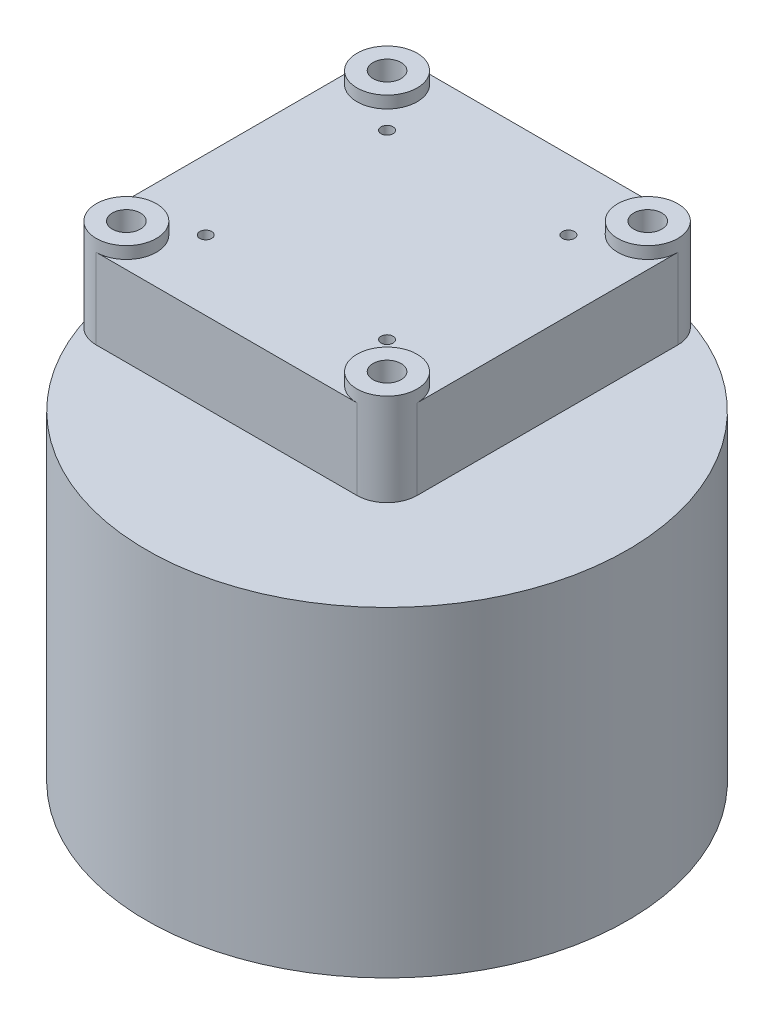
from build123d import *

# Parameters (mm, degrees)
SKETCH1_R           = 3.5
SKETCH1_R_2         = 1.5
BOSS_EXTRUDE1_DEPTH = 20
SKETCH2_R           = 17.5
BOSS_EXTRUDE2_DEPTH = 18
SKETCH3_R           = 60
BOSS_EXTRUDE3_DEPTH = 80
SKETCH4_R           = 7.5
SKETCH4_R_2         = 3.5
BOSS_EXTRUDE5_DEPTH = 3


with BuildPart() as part:
    # Sketch1 → Boss-Extrude1 (new body)
    with BuildSketch(Plane(origin=(0, 0, 0), x_dir=(1, 0, 0), z_dir=(0, 1, 0))):
        with BuildLine():
            Line((-32.5, -40), (32.5, -40))
            ThreePointArc((32.5, -40), (37.803300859, -37.803300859), (40, -32.5))
            Line((40, -32.5), (40, 32.5))
            ThreePointArc((40, 32.5), (37.803300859, 37.803300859), (32.5, 40))
            Line((32.5, 40), (-32.5, 40))
            ThreePointArc((-32.5, 40), (-37.803300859, 37.803300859), (-40, 32.5))
            Line((-40, 32.5), (-40, -32.5))
            ThreePointArc((-40, -32.5), (-37.803300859, -37.803300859), (-32.5, -40))
        make_face()
        with Locations(Location((32.5, 32.5, 0), (0, 0, 270))):
            Circle(SKETCH1_R, mode=Mode.SUBTRACT)
        with Locations(Location((-32.5, -32.5, 0), (0, 0, 90))):
            Circle(SKETCH1_R, mode=Mode.SUBTRACT)
        with Locations(Location((-32.5, 32.5, 0), (0, 0, 90))):
            Circle(SKETCH1_R, mode=Mode.SUBTRACT)
        with Locations(Location((32.5, -32.5, 0), (0, 0, 270))):
            Circle(SKETCH1_R, mode=Mode.SUBTRACT)
        with Locations(Location((22.600505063, -22.600505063, 0), (0, 0, 270))):
            Circle(SKETCH1_R_2, mode=Mode.SUBTRACT)
        with Locations(Location((-22.600505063, -22.600505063, 0), (0, 0, 90))):
            Circle(SKETCH1_R_2, mode=Mode.SUBTRACT)
        with Locations(Location((-22.600505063, 22.600505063, 0), (0, 0, 270))):
            Circle(SKETCH1_R_2, mode=Mode.SUBTRACT)
        with Locations(Location((22.600505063, 22.600505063, 0), (0, 0, 90))):
            Circle(SKETCH1_R_2, mode=Mode.SUBTRACT)
    extrude(amount=BOSS_EXTRUDE1_DEPTH)

    # Sketch2 → Boss-Extrude2 (add)
    with BuildSketch(Plane.XZ):
        with Locations(Location((0, 0, 0), (0, 0, 270))):
            Circle(SKETCH2_R)
    extrude(amount=BOSS_EXTRUDE2_DEPTH)

    # Sketch3 → Boss-Extrude3 (add)
    with BuildSketch(Plane.XZ.offset(18)):
        with Locations(Location((0, 0, 0), (0, 0, 270))):
            Circle(SKETCH3_R)
    extrude(amount=BOSS_EXTRUDE3_DEPTH)

    # Sketch4 → Boss-Extrude5 (add)
    # profile 1 of 4: a face of its own
    with BuildSketch(Plane(origin=(0, 20, 0), x_dir=(1, 0, 0), z_dir=(0, 1, 0))):
        with Locations(Location((32.5, 32.5, 0), (0, 0, 90))):
            Circle(SKETCH4_R)
        with Locations(Location((32.5, 32.5, 0), (0, 0, 270))):
            Circle(SKETCH4_R_2, mode=Mode.SUBTRACT)
    # profile 2 of 4: a face of its own
    with BuildSketch(Plane(origin=(0, 20, 0), x_dir=(1, 0, 0), z_dir=(0, 1, 0))):
        with Locations(Location((32.5, -32.5, 0), (0, 0, 90))):
            Circle(SKETCH4_R)
        with Locations(Location((32.5, -32.5, 0), (0, 0, 90))):
            Circle(SKETCH4_R_2, mode=Mode.SUBTRACT)
    # profile 3 of 4: a face of its own
    with BuildSketch(Plane(origin=(0, 20, 0), x_dir=(1, 0, 0), z_dir=(0, 1, 0))):
        with Locations(Location((-32.5, -32.5, 0), (0, 0, 270))):
            Circle(SKETCH4_R)
        with Locations(Location((-32.5, -32.5, 0), (0, 0, 90))):
            Circle(SKETCH4_R_2, mode=Mode.SUBTRACT)
    # profile 4 of 4: a face of its own
    with BuildSketch(Plane(origin=(0, 20, 0), x_dir=(1, 0, 0), z_dir=(0, 1, 0))):
        with Locations(Location((-32.5, 32.5, 0), (0, 0, 90))):
            Circle(SKETCH4_R)
        with Locations(Location((-32.5, 32.5, 0), (0, 0, 90))):
            Circle(SKETCH4_R_2, mode=Mode.SUBTRACT)
    extrude(amount=BOSS_EXTRUDE5_DEPTH)


solid = part.part
